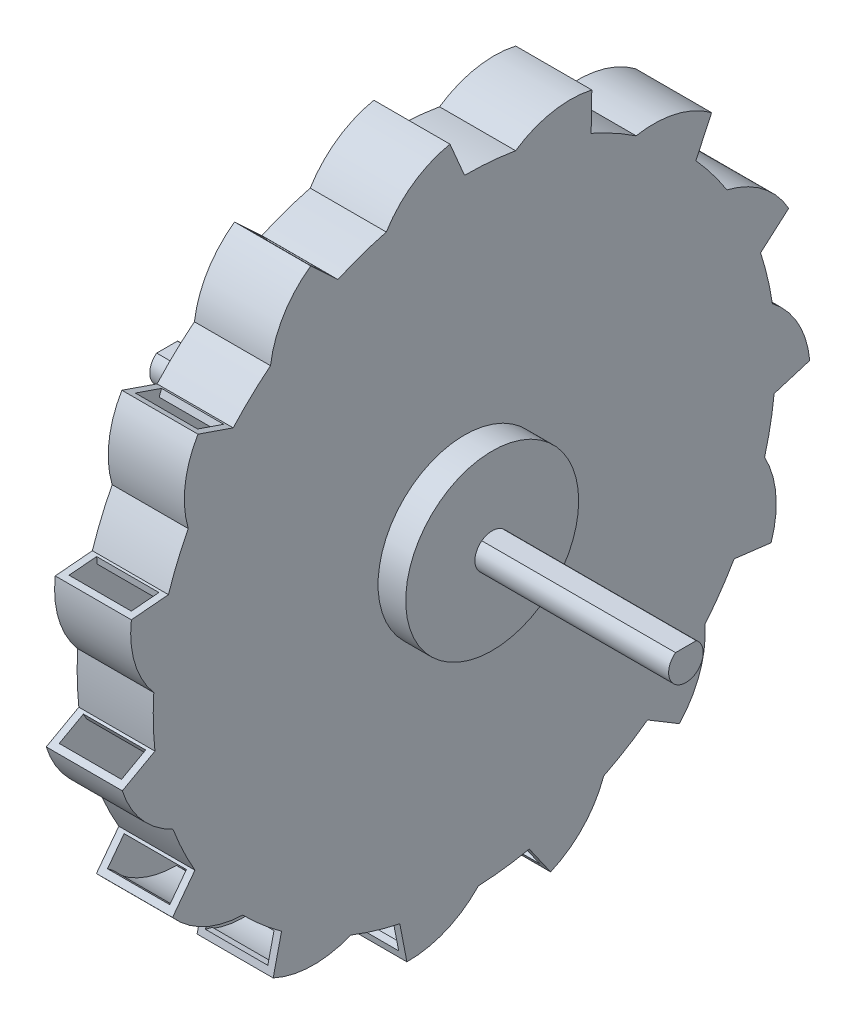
from build123d import *

# Parameters (mm, degrees)
BOSS_EXTRUDE1_DEPTH      = 10
CUT_EXTRUDE1_DEPTH       = 9
CUT_EXTRUDE2_DEPTH       = 9
SKETCH10_R               = 50
BOSS_EXTRUDE4_DEPTH      = 1
CUT_EXTRUDE4_DEPTH       = 1
CUT_EXTRUDE5_DEPTH       = 1
CUT_EXTRUDE6_DEPTH       = 1
CUT_EXTRUDE7_DEPTH       = 1
CUT_EXTRUDE8_DEPTH       = 1
CUT_EXTRUDE10_DEPTH      = 1
CUT_EXTRUDE11_DEPTH      = 1
CUT_EXTRUDE12_DEPTH      = 1
CUT_EXTRUDE13_DEPTH      = 1
CUT_EXTRUDE14_DEPTH      = 1
CUT_EXTRUDE15_DEPTH      = 1
CUT_EXTRUDE16_DEPTH      = 1
SKETCH29_R               = 12.5
SKETCH29_R_2             = 2.5
BOSS_EXTRUDE5_DEPTH      = 4
BOSS_EXTRUDE6_START      = 4
SKETCH30_R               = 12.5
SKETCH30_R_2             = 2.5
BOSS_EXTRUDE6_DEPTH      = 4
SKETCH31_R               = 2.5
CUT_EXTRUDE17_DEPTH      = 14
BOSS_EXTRUDE7_DEPTH      = 28
BOSS_EXTRUDE7_DEPTH_BACK = 47


with BuildPart() as part:
    # Sketch1 → Boss-Extrude1 (new body)
    with BuildSketch(Plane(origin=(0, 0, 0), x_dir=(0, 0, -1), z_dir=(1, 0, 0))):
        with BuildLine():
            Line((18.303148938, 41.109545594), (18.397107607, 46.492434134))
            ThreePointArc((18.397107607, 46.492434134), (12.672012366, 46.591218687), (7.386209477, 44.389682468))
            ThreePointArc((7.386209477, 44.389682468), (12.948961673, 43.09668655), (18.303148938, 41.109545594))
        make_face()
        with BuildLine():
            Line((33.441517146, 30.110877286), (35.716770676, 34.990174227))
            ThreePointArc((35.716770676, 34.990174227), (30.526815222, 37.409024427), (24.802548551, 37.547750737))
            ThreePointArc((24.802548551, 37.547750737), (29.358466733, 34.103965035), (33.441517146, 30.110877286))
        make_face()
        with BuildLine():
            Line((42.797543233, 13.905764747), (46.860679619, 17.437795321))
            ThreePointArc((46.860679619, 17.437795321), (43.103254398, 21.758469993), (37.930301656, 24.213471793))
            ThreePointArc((37.930301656, 24.213471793), (40.691626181, 19.21435814), (42.797543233, 13.905764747))
        make_face()
        with BuildLine():
            ThreePointArc((44.499561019, 6.692463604), (44.874715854, 3.355574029), (45, 0))
            Line((45, 0), (49.249970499, 0))
            ThreePointArc((49.249970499, 0), (47.376181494, 3.702144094), (44.499561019, 6.692463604))
        make_face()
        with BuildLine():
            Line((49.249970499, 0), (45, 0))
            ThreePointArc((45, 0), (44.938329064, -2.355118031), (44.753485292, -4.703780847))
            Line((44.753485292, -4.703780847), (49.901951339, -3.129736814))
            ThreePointArc((49.901951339, -3.129736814), (49.665589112, -1.546197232), (49.249970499, 0))
        make_face()
        with BuildLine():
            ThreePointArc((44.314722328, -23.156109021), (45.011401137, -17.472702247), (43.374442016, -11.985732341))
            ThreePointArc((43.374442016, -11.985732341), (41.507063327, -17.382856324), (38.97114317, -22.5))
            Line((38.97114317, -22.5), (44.314722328, -23.156109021))
        make_face()
        with BuildLine():
            Line((26.450336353, -36.405764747), (31.06507524, -39.178579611))
            ThreePointArc((31.06507524, -39.178579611), (34.013172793, -34.269893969), (34.749487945, -28.591486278))
            ThreePointArc((34.749487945, -28.591486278), (30.848344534, -32.762473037), (26.450336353, -36.405764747))
        make_face()
        with BuildLine():
            Line((0, -46.695934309), (0, -45))
            ThreePointArc((0, -45), (-4.703780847, -44.753485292), (-9.356026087, -44.016642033))
            Line((-9.356026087, -44.016642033), (-8.328766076, -49.301436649))
            ThreePointArc((-8.328766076, -49.301436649), (-3.956182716, -48.664220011), (0, -46.695934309))
        make_face()
        with BuildLine():
            ThreePointArc((20.116031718, -40.253512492), (14.855666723, -42.477160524), (9.356026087, -44.016642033))
            Line((9.356026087, -44.016642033), (12.443994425, -48.426717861))
            ThreePointArc((12.443994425, -48.426717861), (17.133757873, -45.141509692), (20.116031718, -40.253512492))
        make_face()
        with BuildLine():
            Line((-38.97114317, -22.5), (-42.211139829, -26.799620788))
            ThreePointArc((-42.211139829, -26.799620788), (-37.637504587, -30.244665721), (-32.067169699, -31.57050249))
            ThreePointArc((-32.067169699, -31.57050249), (-35.80752683, -27.254743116), (-38.97114317, -22.5))
        make_face()
        with BuildLine():
            ThreePointArc((-27.661407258, -41.651489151), (-22.081957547, -42.938429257), (-16.453937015, -41.883982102))
            ThreePointArc((-16.453937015, -41.883982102), (-21.626300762, -39.462680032), (-26.450336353, -36.405764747))
            Line((-26.450336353, -36.405764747), (-27.661407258, -41.651489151))
        make_face()
        with BuildLine():
            ThreePointArc((-42.135697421, -15.798196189), (-43.797306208, -10.334213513), (-44.753485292, -4.703780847))
            Line((-44.753485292, -4.703780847), (-49.462182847, -7.313854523))
            ThreePointArc((-49.462182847, -7.313854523), (-46.685185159, -12.321324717), (-42.135697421, -15.798196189))
        make_face()
        with BuildLine():
            ThreePointArc((-48.160765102, 13.436543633), (-47.660573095, 7.732485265), (-44.918580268, 2.705761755))
            ThreePointArc((-44.918580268, 2.705761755), (-44.214133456, 8.37319549), (-42.797543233, 13.905764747))
            Line((-42.797543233, 13.905764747), (-48.160765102, 13.436543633))
        make_face()
        with BuildLine():
            Line((-33.441517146, 30.110877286), (-38.531913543, 31.863641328))
            ThreePointArc((-38.531913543, 31.863641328), (-40.39501496, 26.449278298), (-39.934632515, 20.741868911))
            ThreePointArc((-39.934632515, 20.741868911), (-36.985935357, 25.632802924), (-33.441517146, 30.110877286))
        make_face()
        with BuildLine():
            Line((-18.303148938, 41.109545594), (-22.240544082, 44.781225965))
            ThreePointArc((-22.240544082, 44.781225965), (-26.144791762, 40.592750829), (-28.045624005, 35.191518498))
            ThreePointArc((-28.045624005, 35.191518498), (-23.362533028, 38.460265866), (-18.303148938, 41.109545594))
        make_face()
        with BuildLine():
            ThreePointArc((-11.307272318, 43.556234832), (-5.699536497, 44.637599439), (0, 45))
            Line((0, 45), (-2.1035825, 49.955729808))
            ThreePointArc((-2.1035825, 49.955729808), (-7.373896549, 47.717367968), (-11.307272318, 43.556234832))
        make_face()
        with BuildLine():
            ThreePointArc((7.386209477, 44.389682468), (3.705690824, 44.847161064), (0, 45))
            Line((0, 45), (0, 0))
            Line((0, 0), (45, 0))
            ThreePointArc((45, 0), (44.874715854, 3.355574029), (44.499561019, 6.692463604))
            ThreePointArc((44.499561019, 6.692463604), (43.797306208, 10.334213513), (42.797543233, 13.905764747))
            ThreePointArc((42.797543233, 13.905764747), (40.691626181, 19.21435814), (37.930301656, 24.213471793))
            ThreePointArc((37.930301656, 24.213471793), (35.80752683, 27.254743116), (33.441517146, 30.110877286))
            ThreePointArc((33.441517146, 30.110877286), (29.358466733, 34.103965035), (24.802548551, 37.547750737))
            ThreePointArc((24.802548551, 37.547750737), (21.626300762, 39.462680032), (18.303148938, 41.109545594))
            ThreePointArc((18.303148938, 41.109545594), (12.948961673, 43.09668655), (7.386209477, 44.389682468))
        make_face()
        with BuildLine():
            Line((0, 0), (0, 45))
            ThreePointArc((0, 45), (-5.699536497, 44.637599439), (-11.307272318, 43.556234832))
            ThreePointArc((-11.307272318, 43.556234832), (-14.855666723, 42.477160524), (-18.303148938, 41.109545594))
            ThreePointArc((-18.303148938, 41.109545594), (-23.362533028, 38.460265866), (-28.045624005, 35.191518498))
            ThreePointArc((-28.045624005, 35.191518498), (-30.848344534, 32.762473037), (-33.441517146, 30.110877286))
            ThreePointArc((-33.441517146, 30.110877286), (-36.985935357, 25.632802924), (-39.934632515, 20.741868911))
            ThreePointArc((-39.934632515, 20.741868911), (-41.507063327, 17.382856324), (-42.797543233, 13.905764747))
            ThreePointArc((-42.797543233, 13.905764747), (-44.214133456, 8.37319549), (-44.918580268, 2.705761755))
            ThreePointArc((-44.918580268, 2.705761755), (-44.979640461, 1.353493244), (-45, 0))
            Line((-45, 0), (0, 0))
        make_face()
        with BuildLine():
            Line((45, 0), (0, 0))
            Line((0, 0), (0, -45))
            ThreePointArc((0, -45), (1.002414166, -44.988833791), (2.004330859, -44.955340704))
            ThreePointArc((2.004330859, -44.955340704), (5.699536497, -44.637599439), (9.356026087, -44.016642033))
            ThreePointArc((9.356026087, -44.016642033), (14.855666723, -42.477160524), (20.116031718, -40.253512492))
            ThreePointArc((20.116031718, -40.253512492), (23.362533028, -38.460265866), (26.450336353, -36.405764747))
            ThreePointArc((26.450336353, -36.405764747), (30.848344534, -32.762473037), (34.749487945, -28.591486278))
            ThreePointArc((34.749487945, -28.591486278), (36.985935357, -25.632802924), (38.97114317, -22.5))
            ThreePointArc((38.97114317, -22.5), (41.507063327, -17.382856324), (43.374442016, -11.985732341))
            ThreePointArc((43.374442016, -11.985732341), (44.214133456, -8.37319549), (44.753485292, -4.703780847))
            ThreePointArc((44.753485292, -4.703780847), (44.938329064, -2.355118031), (45, 0))
        make_face()
        with BuildLine():
            Line((0, -45), (0, 0))
            Line((0, 0), (-45, 0))
            ThreePointArc((-45, 0), (-44.938329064, -2.355118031), (-44.753485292, -4.703780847))
            ThreePointArc((-44.753485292, -4.703780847), (-43.797306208, -10.334213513), (-42.135697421, -15.798196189))
            ThreePointArc((-42.135697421, -15.798196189), (-40.691626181, -19.21435814), (-38.97114317, -22.5))
            ThreePointArc((-38.97114317, -22.5), (-35.80752683, -27.254743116), (-32.067169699, -31.57050249))
            ThreePointArc((-32.067169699, -31.57050249), (-29.358466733, -34.103965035), (-26.450336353, -36.405764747))
            ThreePointArc((-26.450336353, -36.405764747), (-21.626300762, -39.462680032), (-16.453937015, -41.883982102))
            ThreePointArc((-16.453937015, -41.883982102), (-12.948961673, -43.09668655), (-9.356026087, -44.016642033))
            ThreePointArc((-9.356026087, -44.016642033), (-4.703780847, -44.753485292), (0, -45))
        make_face()
        with BuildLine():
            ThreePointArc((7.386209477, 44.389682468), (3.705690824, 44.847161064), (0, 45))
            Line((0, 45), (0, 0))
            Line((0, 0), (45, 0))
            ThreePointArc((45, 0), (44.874715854, 3.355574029), (44.499561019, 6.692463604))
            ThreePointArc((44.499561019, 6.692463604), (43.797306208, 10.334213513), (42.797543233, 13.905764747))
            ThreePointArc((42.797543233, 13.905764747), (40.691626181, 19.21435814), (37.930301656, 24.213471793))
            ThreePointArc((37.930301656, 24.213471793), (35.80752683, 27.254743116), (33.441517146, 30.110877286))
            ThreePointArc((33.441517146, 30.110877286), (29.358466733, 34.103965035), (24.802548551, 37.547750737))
            ThreePointArc((24.802548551, 37.547750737), (21.626300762, 39.462680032), (18.303148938, 41.109545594))
            ThreePointArc((18.303148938, 41.109545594), (12.948961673, 43.09668655), (7.386209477, 44.389682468))
        make_face()
        with BuildLine():
            Line((0, 0), (0, 45))
            ThreePointArc((0, 45), (-5.699536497, 44.637599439), (-11.307272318, 43.556234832))
            ThreePointArc((-11.307272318, 43.556234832), (-14.855666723, 42.477160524), (-18.303148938, 41.109545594))
            ThreePointArc((-18.303148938, 41.109545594), (-23.362533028, 38.460265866), (-28.045624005, 35.191518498))
            ThreePointArc((-28.045624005, 35.191518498), (-30.848344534, 32.762473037), (-33.441517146, 30.110877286))
            ThreePointArc((-33.441517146, 30.110877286), (-36.985935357, 25.632802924), (-39.934632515, 20.741868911))
            ThreePointArc((-39.934632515, 20.741868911), (-41.507063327, 17.382856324), (-42.797543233, 13.905764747))
            ThreePointArc((-42.797543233, 13.905764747), (-44.214133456, 8.37319549), (-44.918580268, 2.705761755))
            ThreePointArc((-44.918580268, 2.705761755), (-44.979640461, 1.353493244), (-45, 0))
            Line((-45, 0), (0, 0))
        make_face()
        with BuildLine():
            Line((45, 0), (0, 0))
            Line((0, 0), (0, -45))
            ThreePointArc((0, -45), (1.002414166, -44.988833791), (2.004330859, -44.955340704))
            ThreePointArc((2.004330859, -44.955340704), (5.699536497, -44.637599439), (9.356026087, -44.016642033))
            ThreePointArc((9.356026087, -44.016642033), (14.855666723, -42.477160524), (20.116031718, -40.253512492))
            ThreePointArc((20.116031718, -40.253512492), (23.362533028, -38.460265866), (26.450336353, -36.405764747))
            ThreePointArc((26.450336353, -36.405764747), (30.848344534, -32.762473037), (34.749487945, -28.591486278))
            ThreePointArc((34.749487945, -28.591486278), (36.985935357, -25.632802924), (38.97114317, -22.5))
            ThreePointArc((38.97114317, -22.5), (41.507063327, -17.382856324), (43.374442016, -11.985732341))
            ThreePointArc((43.374442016, -11.985732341), (44.214133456, -8.37319549), (44.753485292, -4.703780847))
            ThreePointArc((44.753485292, -4.703780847), (44.938329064, -2.355118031), (45, 0))
        make_face()
        with BuildLine():
            Line((0, -45), (0, 0))
            Line((0, 0), (-45, 0))
            ThreePointArc((-45, 0), (-44.938329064, -2.355118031), (-44.753485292, -4.703780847))
            ThreePointArc((-44.753485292, -4.703780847), (-43.797306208, -10.334213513), (-42.135697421, -15.798196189))
            ThreePointArc((-42.135697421, -15.798196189), (-40.691626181, -19.21435814), (-38.97114317, -22.5))
            ThreePointArc((-38.97114317, -22.5), (-35.80752683, -27.254743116), (-32.067169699, -31.57050249))
            ThreePointArc((-32.067169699, -31.57050249), (-29.358466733, -34.103965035), (-26.450336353, -36.405764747))
            ThreePointArc((-26.450336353, -36.405764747), (-21.626300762, -39.462680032), (-16.453937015, -41.883982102))
            ThreePointArc((-16.453937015, -41.883982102), (-12.948961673, -43.09668655), (-9.356026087, -44.016642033))
            ThreePointArc((-9.356026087, -44.016642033), (-4.703780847, -44.753485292), (0, -45))
        make_face()
        with BuildLine():
            ThreePointArc((7.386209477, 44.389682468), (3.705690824, 44.847161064), (0, 45))
            Line((0, 45), (0, 0))
            Line((0, 0), (45, 0))
            ThreePointArc((45, 0), (44.874715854, 3.355574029), (44.499561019, 6.692463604))
            ThreePointArc((44.499561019, 6.692463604), (43.797306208, 10.334213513), (42.797543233, 13.905764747))
            ThreePointArc((42.797543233, 13.905764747), (40.691626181, 19.21435814), (37.930301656, 24.213471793))
            ThreePointArc((37.930301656, 24.213471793), (35.80752683, 27.254743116), (33.441517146, 30.110877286))
            ThreePointArc((33.441517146, 30.110877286), (29.358466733, 34.103965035), (24.802548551, 37.547750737))
            ThreePointArc((24.802548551, 37.547750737), (21.626300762, 39.462680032), (18.303148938, 41.109545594))
            ThreePointArc((18.303148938, 41.109545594), (12.948961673, 43.09668655), (7.386209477, 44.389682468))
        make_face()
        with BuildLine():
            Line((0, 0), (0, 45))
            ThreePointArc((0, 45), (-5.699536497, 44.637599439), (-11.307272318, 43.556234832))
            ThreePointArc((-11.307272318, 43.556234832), (-14.855666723, 42.477160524), (-18.303148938, 41.109545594))
            ThreePointArc((-18.303148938, 41.109545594), (-23.362533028, 38.460265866), (-28.045624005, 35.191518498))
            ThreePointArc((-28.045624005, 35.191518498), (-30.848344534, 32.762473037), (-33.441517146, 30.110877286))
            ThreePointArc((-33.441517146, 30.110877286), (-36.985935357, 25.632802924), (-39.934632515, 20.741868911))
            ThreePointArc((-39.934632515, 20.741868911), (-41.507063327, 17.382856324), (-42.797543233, 13.905764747))
            ThreePointArc((-42.797543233, 13.905764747), (-44.214133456, 8.37319549), (-44.918580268, 2.705761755))
            ThreePointArc((-44.918580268, 2.705761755), (-44.979640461, 1.353493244), (-45, 0))
            Line((-45, 0), (0, 0))
        make_face()
        with BuildLine():
            Line((45, 0), (0, 0))
            Line((0, 0), (0, -45))
            ThreePointArc((0, -45), (1.002414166, -44.988833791), (2.004330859, -44.955340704))
            ThreePointArc((2.004330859, -44.955340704), (5.699536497, -44.637599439), (9.356026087, -44.016642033))
            ThreePointArc((9.356026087, -44.016642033), (14.855666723, -42.477160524), (20.116031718, -40.253512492))
            ThreePointArc((20.116031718, -40.253512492), (23.362533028, -38.460265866), (26.450336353, -36.405764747))
            ThreePointArc((26.450336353, -36.405764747), (30.848344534, -32.762473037), (34.749487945, -28.591486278))
            ThreePointArc((34.749487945, -28.591486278), (36.985935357, -25.632802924), (38.97114317, -22.5))
            ThreePointArc((38.97114317, -22.5), (41.507063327, -17.382856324), (43.374442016, -11.985732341))
            ThreePointArc((43.374442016, -11.985732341), (44.214133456, -8.37319549), (44.753485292, -4.703780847))
            ThreePointArc((44.753485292, -4.703780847), (44.938329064, -2.355118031), (45, 0))
        make_face()
        with BuildLine():
            Line((0, -45), (0, 0))
            Line((0, 0), (-45, 0))
            ThreePointArc((-45, 0), (-44.938329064, -2.355118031), (-44.753485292, -4.703780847))
            ThreePointArc((-44.753485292, -4.703780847), (-43.797306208, -10.334213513), (-42.135697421, -15.798196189))
            ThreePointArc((-42.135697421, -15.798196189), (-40.691626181, -19.21435814), (-38.97114317, -22.5))
            ThreePointArc((-38.97114317, -22.5), (-35.80752683, -27.254743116), (-32.067169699, -31.57050249))
            ThreePointArc((-32.067169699, -31.57050249), (-29.358466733, -34.103965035), (-26.450336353, -36.405764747))
            ThreePointArc((-26.450336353, -36.405764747), (-21.626300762, -39.462680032), (-16.453937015, -41.883982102))
            ThreePointArc((-16.453937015, -41.883982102), (-12.948961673, -43.09668655), (-9.356026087, -44.016642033))
            ThreePointArc((-9.356026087, -44.016642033), (-4.703780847, -44.753485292), (0, -45))
        make_face()
        with BuildLine():
            ThreePointArc((7.386209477, 44.389682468), (3.705690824, 44.847161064), (0, 45))
            Line((0, 45), (0, 0))
            Line((0, 0), (45, 0))
            ThreePointArc((45, 0), (44.874715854, 3.355574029), (44.499561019, 6.692463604))
            ThreePointArc((44.499561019, 6.692463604), (43.797306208, 10.334213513), (42.797543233, 13.905764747))
            ThreePointArc((42.797543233, 13.905764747), (40.691626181, 19.21435814), (37.930301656, 24.213471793))
            ThreePointArc((37.930301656, 24.213471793), (35.80752683, 27.254743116), (33.441517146, 30.110877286))
            ThreePointArc((33.441517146, 30.110877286), (29.358466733, 34.103965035), (24.802548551, 37.547750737))
            ThreePointArc((24.802548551, 37.547750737), (21.626300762, 39.462680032), (18.303148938, 41.109545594))
            ThreePointArc((18.303148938, 41.109545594), (12.948961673, 43.09668655), (7.386209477, 44.389682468))
        make_face()
        with BuildLine():
            Line((0, 0), (0, 45))
            ThreePointArc((0, 45), (-5.699536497, 44.637599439), (-11.307272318, 43.556234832))
            ThreePointArc((-11.307272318, 43.556234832), (-14.855666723, 42.477160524), (-18.303148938, 41.109545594))
            ThreePointArc((-18.303148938, 41.109545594), (-23.362533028, 38.460265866), (-28.045624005, 35.191518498))
            ThreePointArc((-28.045624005, 35.191518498), (-30.848344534, 32.762473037), (-33.441517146, 30.110877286))
            ThreePointArc((-33.441517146, 30.110877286), (-36.985935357, 25.632802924), (-39.934632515, 20.741868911))
            ThreePointArc((-39.934632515, 20.741868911), (-41.507063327, 17.382856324), (-42.797543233, 13.905764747))
            ThreePointArc((-42.797543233, 13.905764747), (-44.214133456, 8.37319549), (-44.918580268, 2.705761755))
            ThreePointArc((-44.918580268, 2.705761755), (-44.979640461, 1.353493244), (-45, 0))
            Line((-45, 0), (0, 0))
        make_face()
        with BuildLine():
            Line((45, 0), (0, 0))
            Line((0, 0), (0, -45))
            ThreePointArc((0, -45), (1.002414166, -44.988833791), (2.004330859, -44.955340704))
            ThreePointArc((2.004330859, -44.955340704), (5.699536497, -44.637599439), (9.356026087, -44.016642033))
            ThreePointArc((9.356026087, -44.016642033), (14.855666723, -42.477160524), (20.116031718, -40.253512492))
            ThreePointArc((20.116031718, -40.253512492), (23.362533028, -38.460265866), (26.450336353, -36.405764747))
            ThreePointArc((26.450336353, -36.405764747), (30.848344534, -32.762473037), (34.749487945, -28.591486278))
            ThreePointArc((34.749487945, -28.591486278), (36.985935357, -25.632802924), (38.97114317, -22.5))
            ThreePointArc((38.97114317, -22.5), (41.507063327, -17.382856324), (43.374442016, -11.985732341))
            ThreePointArc((43.374442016, -11.985732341), (44.214133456, -8.37319549), (44.753485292, -4.703780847))
            ThreePointArc((44.753485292, -4.703780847), (44.938329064, -2.355118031), (45, 0))
        make_face()
        with BuildLine():
            Line((0, -45), (0, 0))
            Line((0, 0), (-45, 0))
            ThreePointArc((-45, 0), (-44.938329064, -2.355118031), (-44.753485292, -4.703780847))
            ThreePointArc((-44.753485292, -4.703780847), (-43.797306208, -10.334213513), (-42.135697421, -15.798196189))
            ThreePointArc((-42.135697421, -15.798196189), (-40.691626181, -19.21435814), (-38.97114317, -22.5))
            ThreePointArc((-38.97114317, -22.5), (-35.80752683, -27.254743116), (-32.067169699, -31.57050249))
            ThreePointArc((-32.067169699, -31.57050249), (-29.358466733, -34.103965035), (-26.450336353, -36.405764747))
            ThreePointArc((-26.450336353, -36.405764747), (-21.626300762, -39.462680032), (-16.453937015, -41.883982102))
            ThreePointArc((-16.453937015, -41.883982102), (-12.948961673, -43.09668655), (-9.356026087, -44.016642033))
            ThreePointArc((-9.356026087, -44.016642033), (-4.703780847, -44.753485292), (0, -45))
        make_face()
        with BuildLine():
            ThreePointArc((2.004330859, -44.955340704), (1.002414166, -44.988833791), (0, -45))
            Line((0, -45), (0, -46.695934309))
            ThreePointArc((0, -46.695934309), (1.043514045, -45.873251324), (2.004330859, -44.955340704))
        make_face()
    extrude(amount=BOSS_EXTRUDE1_DEPTH)

    # Sketch6 → Cut-Extrude1 (cut)
    with BuildSketch(Plane(origin=(10, 0, 0), x_dir=(0, 0, -1), z_dir=(1, 0, 0))):
        with BuildLine():
            Line((-22.3093073, 43.478021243), (-18.497144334, 39.923121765))
            ThreePointArc((-18.497144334, 39.923121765), (-14.643640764, 41.491731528), (-10.659206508, 42.689358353))
            ThreePointArc((-10.659206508, 42.689358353), (-7.290399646, 46.540385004), (-2.69646194, 48.793161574))
            Line((-2.69646194, 48.793161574), (-0.659785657, 43.995052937))
            ThreePointArc((-0.659785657, 43.995052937), (3.498576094, 43.860688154), (7.625656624, 43.334159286))
            ThreePointArc((7.625656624, 43.334159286), (12.269568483, 45.482029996), (17.382626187, 45.671520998))
            Line((17.382626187, 45.671520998), (17.291655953, 40.459839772))
            ThreePointArc((17.291655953, 40.459839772), (21.035857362, 38.645733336), (24.591974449, 36.4860904))
            ThreePointArc((24.591974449, 36.4860904), (29.708016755, 36.55941881), (34.45610033, 34.652859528))
            Line((34.45610033, 34.652859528), (32.253213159, 29.928752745))
            ThreePointArc((32.253213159, 29.928752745), (34.935847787, 26.748580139), (37.306116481, 23.329245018))
            ThreePointArc((37.306116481, 23.329245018), (42.009679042, 21.315351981), (45.571801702, 17.642403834))
            Line((45.571801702, 17.642403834), (41.637896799, 14.222712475))
            ThreePointArc((41.637896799, 14.222712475), (42.795112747, 10.226354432), (43.569692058, 6.138561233))
            ThreePointArc((43.569692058, 6.138561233), (47.047486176, 2.38566715), (48.807724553, -2.418583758))
            Line((48.807724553, -2.418583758), (43.823009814, -3.942563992))
            ThreePointArc((43.823009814, -3.942563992), (43.254713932, -8.064100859), (42.299672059, -12.113535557))
            ThreePointArc((42.299672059, -12.113535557), (43.950355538, -16.956521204), (43.604348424, -22.061376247))
            Line((43.604348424, -22.061376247), (38.430726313, -21.426135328))
            ThreePointArc((38.430726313, -21.426135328), (36.235182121, -24.960199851), (33.715654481, -28.271092))
            ThreePointArc((33.715654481, -28.271092), (33.253809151, -33.366772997), (30.86138432, -37.889556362))
            Line((30.86138432, -37.889556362), (26.393421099, -35.204933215))
            ThreePointArc((26.393421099, -35.204933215), (22.950258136, -37.540453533), (19.301893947, -39.540319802))
            ThreePointArc((19.301893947, -39.540319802), (16.80737706, -44.007606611), (12.7822065, -47.166287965))
            Line((12.7822065, -47.166287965), (9.792453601, -42.896478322))
            ThreePointArc((9.792453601, -42.896478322), (5.697026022, -43.629621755), (1.550660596, -43.972667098))
            ThreePointArc((1.550660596, -43.972667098), (-2.545203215, -47.039125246), (-7.507130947, -48.287539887))
            Line((-7.507130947, -48.287539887), (-8.501718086, -43.170832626))
            ThreePointArc((-8.501718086, -43.170832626), (-12.541273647, -42.174832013), (-16.468696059, -40.801740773))
            ThreePointArc((-16.468696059, -40.801740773), (-21.457694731, -41.937151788), (-26.498417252, -41.059437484))
            Line((-26.498417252, -41.059437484), (-25.32586548, -35.980557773))
            ThreePointArc((-25.32586548, -35.980557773), (-28.611073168, -33.427630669), (-31.640465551, -30.575822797))
            ThreePointArc((-31.640465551, -30.575822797), (-36.659955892, -29.583863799), (-40.907886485, -26.731785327))
            Line((-40.907886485, -26.731785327), (-37.770940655, -22.568917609))
            ThreePointArc((-37.770940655, -22.568917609), (-39.733758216, -18.900488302), (-41.341311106, -15.063067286))
            ThreePointArc((-41.341311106, -15.063067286), (-45.523377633, -12.115256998), (-48.244010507, -7.781964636))
            Line((-48.244010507, -7.781964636), (-43.685077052, -5.254906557))
            ThreePointArc((-43.685077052, -5.254906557), (-43.986115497, -1.105279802), (-43.893868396, 3.054229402))
            ThreePointArc((-43.893868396, 3.054229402), (-46.515393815, 7.448187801), (-47.23830683, 12.513428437))
            Line((-47.23830683, 12.513428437), (-42.045666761, 12.967725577))
            ThreePointArc((-42.045666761, 12.967725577), (-40.632873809, 16.881041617), (-38.856777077, 20.64342208))
            ThreePointArc((-38.856777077, 20.64342208), (-39.464475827, 25.723773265), (-38.064670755, 30.645136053))
            Line((-38.064670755, 30.645136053), (-33.136178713, 28.948120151))
            ThreePointArc((-33.136178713, 28.948120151), (-30.2538391, 31.94847758), (-27.100995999, 34.663179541))
            ThreePointArc((-27.100995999, 34.663179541), (-25.589791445, 39.551484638), (-22.3093073, 43.478021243))
        make_face()
    extrude(amount=-CUT_EXTRUDE1_DEPTH, mode=Mode.SUBTRACT)

    # Sketch7 → Cut-Extrude2 (cut)
    with BuildSketch(Plane(origin=(10, 0, 0), x_dir=(0, 0, -1), z_dir=(1, 0, 0))):
        Polygon((-22.19118874, 43.367873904), (-21.50919038, 44.099227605), (-18.583775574, 41.371234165), (-19.265773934, 40.639880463), align=None)
        Polygon((-0.149926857, 45.353205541), (-1.070431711, 44.962474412), (-2.633356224, 48.644493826), (-1.712851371, 49.035224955), align=None)
        Polygon((18.309845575, 41.493195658), (17.30999788, 41.510648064), (17.379807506, 45.510038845), (18.379655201, 45.492586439), align=None)
        Polygon((33.603679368, 30.458635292), (32.697371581, 30.881253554), (34.387844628, 34.506484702), (35.294152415, 34.08386644), align=None)
        Polygon((43.087131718, 14.157500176), (42.431072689, 14.912209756), (45.44991101, 17.536445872), (46.105970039, 16.781736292), align=None)
        Polygon((45.12042756, -4.591595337), (44.828055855, -3.635290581), (48.653274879, -2.465803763), (48.945646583, -3.422108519), align=None)
        Polygon((39.35199157, -22.546762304), (39.473860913, -21.554216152), (43.44404552, -22.041693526), (43.322176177, -23.034239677), align=None)
        Polygon((26.779238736, -36.603389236), (27.294276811, -35.746221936), (30.722946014, -37.806374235), (30.207907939, -38.663541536), align=None)
        Polygon((9.576112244, -44.330957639), (10.395264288, -43.757381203), (12.689570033, -47.03398938), (11.870417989, -47.607565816), align=None)
        Polygon((-9.282811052, -44.393300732), (-8.301183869, -44.202491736), (-7.537947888, -48.12900047), (-8.519575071, -48.319809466), align=None)
        Polygon((-26.536651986, -36.779638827), (-25.562281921, -37.004589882), (-26.462086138, -40.902070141), (-27.436456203, -40.677119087), align=None)
        Polygon((-39.202064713, -22.806443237), (-38.403429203, -23.408258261), (-40.810689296, -26.602800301), (-41.609324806, -26.000985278), align=None)
        Polygon((-45.089084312, -4.889806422), (-44.604274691, -5.764426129), (-48.10275352, -7.70366461), (-48.58756314, -6.829044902), align=None)
        Polygon((-43.179791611, 13.872322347), (-43.092635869, 12.876127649), (-47.077414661, 12.527504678), (-47.164570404, 13.523699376), align=None)
        Polygon((-33.804320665, 30.235800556), (-34.12988882, 29.29028198), (-37.911963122, 30.592554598), (-37.586394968, 31.538073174), align=None)
    extrude(amount=-CUT_EXTRUDE2_DEPTH, mode=Mode.SUBTRACT)

    # Sketch10 → Boss-Extrude4 (add)
    with BuildSketch(Plane(origin=(10, 0, 0), x_dir=(0, 0, -1), z_dir=(1, 0, 0))):
        with Locations(Location((0, 0, 0), (0, 0, 188.411239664))):
            Circle(SKETCH10_R)
    extrude(amount=BOSS_EXTRUDE4_DEPTH)

    # Sketch14 → Cut-Extrude4 (cut)
    with BuildSketch(Plane.ZY.offset(-10)):
        with BuildLine():
            Line((-18.303148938, 41.109545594), (-18.397107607, 46.492434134))
            ThreePointArc((-18.397107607, 46.492434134), (-27.661407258, 41.651489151), (-35.716770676, 34.990174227))
            ThreePointArc((-35.716770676, 34.990174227), (-30.526815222, 37.409024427), (-24.802548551, 37.547750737))
            ThreePointArc((-24.802548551, 37.547750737), (-21.626300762, 39.462680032), (-18.303148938, 41.109545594))
        make_face()
    extrude(amount=-CUT_EXTRUDE4_DEPTH, mode=Mode.SUBTRACT)

    # Sketch16 → Cut-Extrude5 (cut)
    with BuildSketch(Plane.ZY.offset(-10)):
        with BuildLine():
            ThreePointArc((-37.930301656, 24.213471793), (-35.80752683, 27.254743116), (-33.441517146, 30.110877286))
            Line((-33.441517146, 30.110877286), (-35.716770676, 34.990174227))
            ThreePointArc((-35.716770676, 34.990174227), (-42.211139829, 26.799620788), (-46.860679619, 17.437795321))
            ThreePointArc((-46.860679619, 17.437795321), (-43.103254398, 21.758469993), (-37.930301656, 24.213471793))
        make_face()
        with BuildLine():
            Line((-42.797543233, 13.905764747), (-46.860679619, 17.437795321))
            ThreePointArc((-46.860679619, 17.437795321), (-49.462182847, 7.313854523), (-49.901951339, -3.129736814))
            ThreePointArc((-49.901951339, -3.129736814), (-48.226749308, 2.345678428), (-44.499561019, 6.692463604))
            ThreePointArc((-44.499561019, 6.692463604), (-43.797306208, 10.334213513), (-42.797543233, 13.905764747))
        make_face()
    extrude(amount=-CUT_EXTRUDE5_DEPTH, mode=Mode.SUBTRACT)

    # Sketch17 → Cut-Extrude6 (cut)
    with BuildSketch(Plane.ZY.offset(-10)):
        with BuildLine():
            ThreePointArc((-34.749487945, -28.591486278), (-34.013172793, -34.269893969), (-31.06507524, -39.178579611))
            ThreePointArc((-31.06507524, -39.178579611), (-38.531913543, -31.863641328), (-44.314722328, -23.156109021))
            Line((-44.314722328, -23.156109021), (-38.97114317, -22.5))
            ThreePointArc((-38.97114317, -22.5), (-36.985935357, -25.632802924), (-34.749487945, -28.591486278))
        make_face()
        with BuildLine():
            ThreePointArc((-43.374442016, -11.985732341), (-45.011401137, -17.472702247), (-44.314722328, -23.156109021))
            ThreePointArc((-44.314722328, -23.156109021), (-48.160765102, -13.436543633), (-49.901951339, -3.129736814))
            Line((-49.901951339, -3.129736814), (-44.753485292, -4.703780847))
            ThreePointArc((-44.753485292, -4.703780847), (-44.214133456, -8.37319549), (-43.374442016, -11.985732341))
        make_face()
        with BuildLine():
            Line((-26.450336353, -36.405764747), (-31.06507524, -39.178579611))
            ThreePointArc((-31.06507524, -39.178579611), (-22.240544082, -44.781225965), (-12.443994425, -48.426717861))
            ThreePointArc((-12.443994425, -48.426717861), (-17.133757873, -45.141509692), (-20.116031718, -40.253512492))
            ThreePointArc((-20.116031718, -40.253512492), (-23.362533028, -38.460265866), (-26.450336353, -36.405764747))
        make_face()
    extrude(amount=-CUT_EXTRUDE6_DEPTH, mode=Mode.SUBTRACT)

    # Sketch19 → Cut-Extrude7 (cut)
    with BuildSketch(Plane.ZY.offset(-10)):
        with BuildLine():
            Line((-9.356026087, -44.016642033), (-12.443994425, -48.426717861))
            ThreePointArc((-12.443994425, -48.426717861), (-2.1035825, -49.955729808), (8.328766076, -49.301436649))
            ThreePointArc((8.328766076, -49.301436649), (2.708239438, -48.207748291), (-2.004330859, -44.955340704))
            ThreePointArc((-2.004330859, -44.955340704), (-5.699536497, -44.637599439), (-9.356026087, -44.016642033))
        make_face()
    extrude(amount=-CUT_EXTRUDE7_DEPTH, mode=Mode.SUBTRACT)

    # Sketch20 → Cut-Extrude8 (cut)
    with BuildSketch(Plane.ZY.offset(-10)):
        with BuildLine():
            Line((0, 45), (2.1035825, 49.955729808))
            ThreePointArc((2.1035825, 49.955729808), (-8.328766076, 49.301436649), (-18.397107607, 46.492434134))
            ThreePointArc((-18.397107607, 46.492434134), (-12.672012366, 46.591218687), (-7.386209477, 44.389682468))
            ThreePointArc((-7.386209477, 44.389682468), (-3.705690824, 44.847161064), (0, 45))
        make_face()
    extrude(amount=-CUT_EXTRUDE8_DEPTH, mode=Mode.SUBTRACT)

    # Sketch22 → Cut-Extrude10 (cut)
    with BuildSketch(Plane.ZY.offset(-10)):
        with BuildLine():
            Line((9.356026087, -44.016642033), (8.328766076, -49.301436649))
            ThreePointArc((8.328766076, -49.301436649), (18.397107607, -46.492434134), (27.661407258, -41.651489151))
            ThreePointArc((27.661407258, -41.651489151), (22.081957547, -42.938429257), (16.453937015, -41.883982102))
            ThreePointArc((16.453937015, -41.883982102), (12.948961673, -43.09668655), (9.356026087, -44.016642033))
        make_face()
    extrude(amount=-CUT_EXTRUDE10_DEPTH, mode=Mode.SUBTRACT)

    # Sketch23 → Cut-Extrude11 (cut)
    with BuildSketch(Plane.ZY.offset(-10)):
        with BuildLine():
            Line((26.450336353, -36.405764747), (27.661407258, -41.651489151))
            ThreePointArc((27.661407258, -41.651489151), (35.716770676, -34.990174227), (42.211139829, -26.799620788))
            ThreePointArc((42.211139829, -26.799620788), (37.637504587, -30.244665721), (32.067169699, -31.57050249))
            ThreePointArc((32.067169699, -31.57050249), (29.358466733, -34.103965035), (26.450336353, -36.405764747))
        make_face()
    extrude(amount=-CUT_EXTRUDE11_DEPTH, mode=Mode.SUBTRACT)

    # Sketch24 → Cut-Extrude12 (cut)
    with BuildSketch(Plane.ZY.offset(-10)):
        with BuildLine():
            Line((18.303148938, 41.109545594), (22.240544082, 44.781225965))
            ThreePointArc((22.240544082, 44.781225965), (12.443994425, 48.426717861), (2.1035825, 49.955729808))
            ThreePointArc((2.1035825, 49.955729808), (7.373896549, 47.717367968), (11.307272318, 43.556234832))
            ThreePointArc((11.307272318, 43.556234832), (14.855666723, 42.477160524), (18.303148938, 41.109545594))
        make_face()
    extrude(amount=-CUT_EXTRUDE12_DEPTH, mode=Mode.SUBTRACT)

    # Sketch25 → Cut-Extrude13 (cut)
    with BuildSketch(Plane.ZY.offset(-10)):
        with BuildLine():
            Line((33.441517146, 30.110877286), (38.531913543, 31.863641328))
            ThreePointArc((38.531913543, 31.863641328), (31.06507524, 39.178579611), (22.240544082, 44.781225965))
            ThreePointArc((22.240544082, 44.781225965), (26.144791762, 40.592750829), (28.045624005, 35.191518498))
            ThreePointArc((28.045624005, 35.191518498), (30.848344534, 32.762473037), (33.441517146, 30.110877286))
        make_face()
    extrude(amount=-CUT_EXTRUDE13_DEPTH, mode=Mode.SUBTRACT)

    # Sketch26 → Cut-Extrude14 (cut)
    with BuildSketch(Plane.ZY.offset(-10)):
        with BuildLine():
            Line((42.797543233, 13.905764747), (48.160765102, 13.436543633))
            ThreePointArc((48.160765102, 13.436543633), (44.314722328, 23.156109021), (38.531913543, 31.863641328))
            ThreePointArc((38.531913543, 31.863641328), (40.39501496, 26.449278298), (39.934632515, 20.741868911))
            ThreePointArc((39.934632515, 20.741868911), (41.507063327, 17.382856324), (42.797543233, 13.905764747))
        make_face()
    extrude(amount=-CUT_EXTRUDE14_DEPTH, mode=Mode.SUBTRACT)

    # Sketch27 → Cut-Extrude15 (cut)
    with BuildSketch(Plane.ZY.offset(-10)):
        with BuildLine():
            Line((44.753485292, -4.703780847), (49.462182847, -7.313854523))
            ThreePointArc((49.462182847, -7.313854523), (49.901951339, 3.129736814), (48.160765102, 13.436543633))
            ThreePointArc((48.160765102, 13.436543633), (47.660573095, 7.732485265), (44.918580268, 2.705761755))
            ThreePointArc((44.918580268, 2.705761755), (44.988833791, -1.002414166), (44.753485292, -4.703780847))
        make_face()
    extrude(amount=-CUT_EXTRUDE15_DEPTH, mode=Mode.SUBTRACT)

    # Sketch28 → Cut-Extrude16 (cut)
    with BuildSketch(Plane.ZY.offset(-10)):
        with BuildLine():
            Line((38.97114317, -22.5), (42.211139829, -26.799620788))
            ThreePointArc((42.211139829, -26.799620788), (46.860679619, -17.437795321), (49.462182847, -7.313854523))
            ThreePointArc((49.462182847, -7.313854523), (46.685185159, -12.321324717), (42.135697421, -15.798196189))
            ThreePointArc((42.135697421, -15.798196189), (40.691626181, -19.21435814), (38.97114317, -22.5))
        make_face()
    extrude(amount=-CUT_EXTRUDE16_DEPTH, mode=Mode.SUBTRACT)

    # Sketch29 → Boss-Extrude5 (add)
    with BuildSketch(Plane.ZY):
        with Locations(Location((0, 0, 0), (0, 0, 180))):
            Circle(SKETCH29_R)
        Circle(SKETCH29_R_2, mode=Mode.SUBTRACT)
    extrude(amount=BOSS_EXTRUDE5_DEPTH)

    # Sketch30 → Boss-Extrude6 (add)
    with BuildSketch(Plane(origin=(11, 0, 0), x_dir=(0, 0, -1), z_dir=(1, 0, 0)).offset(BOSS_EXTRUDE6_START)):
        Circle(SKETCH30_R)
        with Locations(Location((0, 0, 0), (0, 0, 180))):
            Circle(SKETCH30_R_2, mode=Mode.SUBTRACT)
    extrude(amount=-BOSS_EXTRUDE6_DEPTH)

    # Sketch31 → Cut-Extrude17 (cut)
    with BuildSketch(Plane(origin=(11, 0, 0), x_dir=(0, 0, -1), z_dir=(1, 0, 0))):
        Circle(SKETCH31_R)
    extrude(amount=-CUT_EXTRUDE17_DEPTH, mode=Mode.SUBTRACT)

    # Sketch32 → Boss-Extrude7 (add, two sides: drawn at the far end of the back side and taken through both)
    with BuildSketch(Plane.ZY.offset(4).offset(-BOSS_EXTRUDE7_DEPTH_BACK)):
        with BuildLine():
            Line((-1.5, 2), (1.5, 2))
            ThreePointArc((1.5, 2), (0, -2.5), (-1.5, 2))
        make_face()
    extrude(amount=BOSS_EXTRUDE7_DEPTH + BOSS_EXTRUDE7_DEPTH_BACK)


solid = part.part
